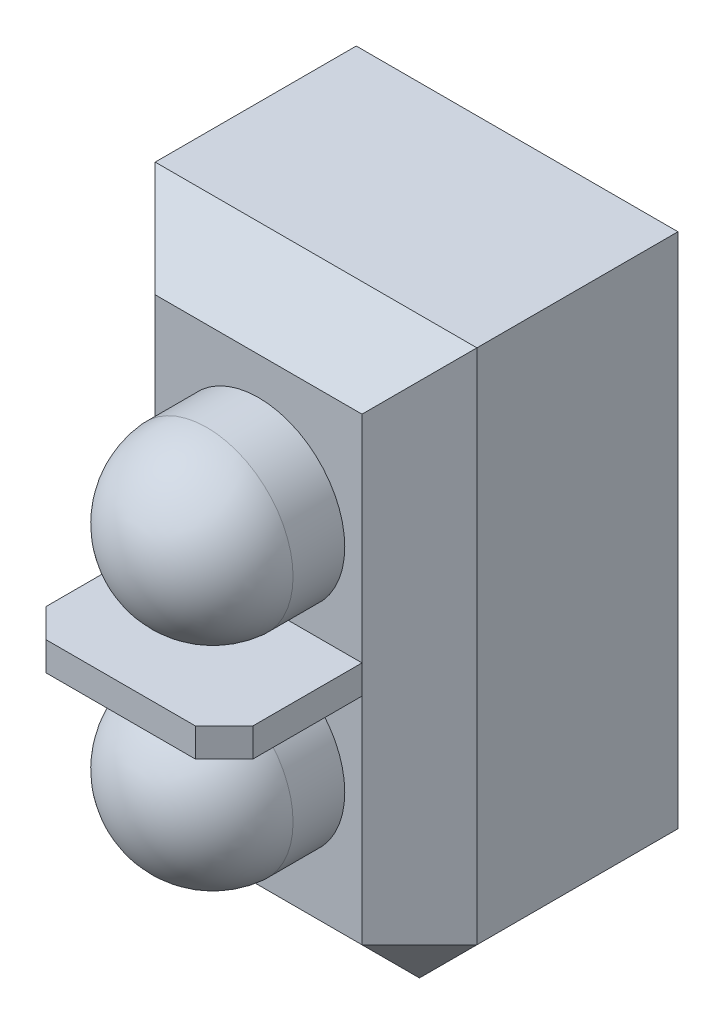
ISO-10303-21;
HEADER;
FILE_DESCRIPTION(('STEP AP214'),'2;1');
FILE_NAME('part.step','',(''),(''),'','','');
FILE_SCHEMA(('AUTOMOTIVE_DESIGN { 1 0 10303 214 1 1 1 1 }'));
ENDSEC;
DATA;
#1=APPLICATION_CONTEXT('core data for automotive mechanical design processes');
#2=APPLICATION_PROTOCOL_DEFINITION('international standard','automotive_design',2000,#1);
#3=PRODUCT_CONTEXT('',#1,'mechanical');
#4=PRODUCT('Part','Part','',(#3));
#5=PRODUCT_RELATED_PRODUCT_CATEGORY('part','',(#4));
#6=PRODUCT_DEFINITION_FORMATION('','',#4);
#7=PRODUCT_DEFINITION_CONTEXT('part definition',#1,'design');
#8=PRODUCT_DEFINITION('design','',#6,#7);
#9=PRODUCT_DEFINITION_SHAPE('','',#8);
#10=(LENGTH_UNIT() NAMED_UNIT(*) SI_UNIT(.MILLI.,.METRE.));
#11=(NAMED_UNIT(*) PLANE_ANGLE_UNIT() SI_UNIT($,.RADIAN.));
#12=(NAMED_UNIT(*) SI_UNIT($,.STERADIAN.) SOLID_ANGLE_UNIT());
#13=UNCERTAINTY_MEASURE_WITH_UNIT(LENGTH_MEASURE(1.E-05),#10,'distance_accuracy_value','');
#14=(GEOMETRIC_REPRESENTATION_CONTEXT(3) GLOBAL_UNCERTAINTY_ASSIGNED_CONTEXT((#13)) GLOBAL_UNIT_ASSIGNED_CONTEXT((#10,
#11,#12)) REPRESENTATION_CONTEXT('',''));
#15=CARTESIAN_POINT('',(0.,0.,0.));
#16=DIRECTION('',(0.,0.,1.));
#17=DIRECTION('',(1.,0.,0.));
#18=AXIS2_PLACEMENT_3D('',#15,#16,#17);
#19=CARTESIAN_POINT('',(2.8,-5.,0.));
#20=DIRECTION('',(0.,0.,1.));
#21=DIRECTION('',(1.,0.,0.));
#22=AXIS2_PLACEMENT_3D('',#19,#20,#21);
#23=PLANE('',#22);
#24=DIRECTION('',(0.,1.,0.));
#25=VECTOR('',#24,1.);
#26=CARTESIAN_POINT('',(-1.075,-1.65,0.));
#27=LINE('',#26,#25);
#28=CARTESIAN_POINT('',(-1.075,-2.05,0.));
#29=VERTEX_POINT('',#28);
#30=CARTESIAN_POINT('',(-1.075,-1.65,0.));
#31=VERTEX_POINT('',#30);
#32=EDGE_CURVE('E252',#29,#31,#27,.T.);
#33=ORIENTED_EDGE('',*,*,#32,.F.);
#34=DIRECTION('',(-1.,0.,0.));
#35=VECTOR('',#34,1.);
#36=CARTESIAN_POINT('',(-1.075,-2.05,0.));
#37=LINE('',#36,#35);
#38=CARTESIAN_POINT('',(-0.424999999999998,-2.05,0.));
#39=VERTEX_POINT('',#38);
#40=EDGE_CURVE('E265',#39,#29,#37,.T.);
#41=ORIENTED_EDGE('',*,*,#40,.F.);
#42=DIRECTION('',(0.,-1.,0.));
#43=VECTOR('',#42,1.);
#44=CARTESIAN_POINT('',(-0.424999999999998,-1.65,0.));
#45=LINE('',#44,#43);
#46=CARTESIAN_POINT('',(-0.424999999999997,-1.65,0.));
#47=VERTEX_POINT('',#46);
#48=EDGE_CURVE('E274',#47,#39,#45,.T.);
#49=ORIENTED_EDGE('',*,*,#48,.F.);
#50=DIRECTION('',(1.,0.,0.));
#51=VECTOR('',#50,1.);
#52=CARTESIAN_POINT('',(-1.075,-1.65,0.));
#53=LINE('',#52,#51);
#54=EDGE_CURVE('E255',#31,#47,#53,.T.);
#55=ORIENTED_EDGE('',*,*,#54,.F.);
#56=EDGE_LOOP('',(#33,#41,#49,#55));
#57=FACE_BOUND('',#56,.T.);
#58=DIRECTION('',(0.,1.,0.));
#59=VECTOR('',#58,1.);
#60=CARTESIAN_POINT('',(0.424999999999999,1.65,0.));
#61=LINE('',#60,#59);
#62=CARTESIAN_POINT('',(0.424999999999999,1.65,0.));
#63=VERTEX_POINT('',#62);
#64=CARTESIAN_POINT('',(0.424999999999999,2.05,0.));
#65=VERTEX_POINT('',#64);
#66=EDGE_CURVE('E323',#63,#65,#61,.T.);
#67=ORIENTED_EDGE('',*,*,#66,.F.);
#68=DIRECTION('',(-1.,0.,0.));
#69=VECTOR('',#68,1.);
#70=CARTESIAN_POINT('',(1.075,1.65,0.));
#71=LINE('',#70,#69);
#72=CARTESIAN_POINT('',(1.075,1.65,0.));
#73=VERTEX_POINT('',#72);
#74=EDGE_CURVE('E328',#73,#63,#71,.T.);
#75=ORIENTED_EDGE('',*,*,#74,.F.);
#76=DIRECTION('',(0.,-1.,0.));
#77=VECTOR('',#76,1.);
#78=CARTESIAN_POINT('',(1.075,1.65,0.));
#79=LINE('',#78,#77);
#80=CARTESIAN_POINT('',(1.075,2.05,0.));
#81=VERTEX_POINT('',#80);
#82=EDGE_CURVE('E340',#81,#73,#79,.T.);
#83=ORIENTED_EDGE('',*,*,#82,.F.);
#84=DIRECTION('',(1.,0.,0.));
#85=VECTOR('',#84,1.);
#86=CARTESIAN_POINT('',(1.075,2.05,0.));
#87=LINE('',#86,#85);
#88=EDGE_CURVE('E337',#65,#81,#87,.T.);
#89=ORIENTED_EDGE('',*,*,#88,.F.);
#90=EDGE_LOOP('',(#67,#75,#83,#89));
#91=FACE_BOUND('',#90,.T.);
#92=DIRECTION('',(0.,1.,0.));
#93=VECTOR('',#92,1.);
#94=CARTESIAN_POINT('',(2.8,5.,0.));
#95=LINE('',#94,#93);
#96=CARTESIAN_POINT('',(2.8,-3.99999999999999,0.));
#97=VERTEX_POINT('',#96);
#98=CARTESIAN_POINT('',(2.8,5.,0.));
#99=VERTEX_POINT('',#98);
#100=EDGE_CURVE('E390',#97,#99,#95,.T.);
#101=ORIENTED_EDGE('',*,*,#100,.F.);
#102=DIRECTION('',(0.707106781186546,0.707106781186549,0.));
#103=VECTOR('',#102,1.);
#104=CARTESIAN_POINT('',(2.8,-3.99999999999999,0.));
#105=LINE('',#104,#103);
#106=CARTESIAN_POINT('',(1.8,-5.,0.));
#107=VERTEX_POINT('',#106);
#108=EDGE_CURVE('E414',#97,#107,#105,.F.);
#109=ORIENTED_EDGE('',*,*,#108,.T.);
#110=DIRECTION('',(1.,0.,0.));
#111=VECTOR('',#110,1.);
#112=CARTESIAN_POINT('',(-2.8,-5.,0.));
#113=LINE('',#112,#111);
#114=CARTESIAN_POINT('',(-1.79999999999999,-5.,0.));
#115=VERTEX_POINT('',#114);
#116=EDGE_CURVE('E400',#115,#107,#113,.T.);
#117=ORIENTED_EDGE('',*,*,#116,.F.);
#118=DIRECTION('',(0.707106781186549,-0.707106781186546,0.));
#119=VECTOR('',#118,1.);
#120=CARTESIAN_POINT('',(-1.79999999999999,-5.,0.));
#121=LINE('',#120,#119);
#122=CARTESIAN_POINT('',(-2.8,-4.,0.));
#123=VERTEX_POINT('',#122);
#124=EDGE_CURVE('E412',#115,#123,#121,.F.);
#125=ORIENTED_EDGE('',*,*,#124,.T.);
#126=DIRECTION('',(0.,-1.,0.));
#127=VECTOR('',#126,1.);
#128=CARTESIAN_POINT('',(-2.8,5.,0.));
#129=LINE('',#128,#127);
#130=CARTESIAN_POINT('',(-2.8,5.,0.));
#131=VERTEX_POINT('',#130);
#132=EDGE_CURVE('E397',#131,#123,#129,.T.);
#133=ORIENTED_EDGE('',*,*,#132,.F.);
#134=DIRECTION('',(-1.,0.,0.));
#135=VECTOR('',#134,1.);
#136=CARTESIAN_POINT('',(-2.8,5.,0.));
#137=LINE('',#136,#135);
#138=EDGE_CURVE('E393',#99,#131,#137,.T.);
#139=ORIENTED_EDGE('',*,*,#138,.F.);
#140=EDGE_LOOP('',(#101,#109,#117,#125,#133,#139));
#141=FACE_BOUND('',#140,.T.);
#142=DIRECTION('',(-1.,0.,0.));
#143=VECTOR('',#142,1.);
#144=CARTESIAN_POINT('',(-1.075,1.65,0.));
#145=LINE('',#144,#143);
#146=CARTESIAN_POINT('',(-0.424999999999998,1.65,0.));
#147=VERTEX_POINT('',#146);
#148=CARTESIAN_POINT('',(-1.075,1.65,0.));
#149=VERTEX_POINT('',#148);
#150=EDGE_CURVE('E290',#147,#149,#145,.T.);
#151=ORIENTED_EDGE('',*,*,#150,.F.);
#152=DIRECTION('',(0.,-1.,0.));
#153=VECTOR('',#152,1.);
#154=CARTESIAN_POINT('',(-0.424999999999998,1.65,0.));
#155=LINE('',#154,#153);
#156=CARTESIAN_POINT('',(-0.424999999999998,2.05,0.));
#157=VERTEX_POINT('',#156);
#158=EDGE_CURVE('E295',#157,#147,#155,.T.);
#159=ORIENTED_EDGE('',*,*,#158,.F.);
#160=DIRECTION('',(1.,0.,0.));
#161=VECTOR('',#160,1.);
#162=CARTESIAN_POINT('',(-1.075,2.05,0.));
#163=LINE('',#162,#161);
#164=CARTESIAN_POINT('',(-1.075,2.05,0.));
#165=VERTEX_POINT('',#164);
#166=EDGE_CURVE('E307',#165,#157,#163,.T.);
#167=ORIENTED_EDGE('',*,*,#166,.F.);
#168=DIRECTION('',(0.,1.,0.));
#169=VECTOR('',#168,1.);
#170=CARTESIAN_POINT('',(-1.075,1.65,0.));
#171=LINE('',#170,#169);
#172=EDGE_CURVE('E304',#149,#165,#171,.T.);
#173=ORIENTED_EDGE('',*,*,#172,.F.);
#174=EDGE_LOOP('',(#151,#159,#167,#173));
#175=FACE_BOUND('',#174,.T.);
#176=DIRECTION('',(1.,0.,0.));
#177=VECTOR('',#176,1.);
#178=CARTESIAN_POINT('',(1.075,-1.65,0.));
#179=LINE('',#178,#177);
#180=CARTESIAN_POINT('',(0.424999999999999,-1.65,0.));
#181=VERTEX_POINT('',#180);
#182=CARTESIAN_POINT('',(1.075,-1.65,0.));
#183=VERTEX_POINT('',#182);
#184=EDGE_CURVE('E251',#181,#183,#179,.T.);
#185=ORIENTED_EDGE('',*,*,#184,.F.);
#186=DIRECTION('',(0.,1.,0.));
#187=VECTOR('',#186,1.);
#188=CARTESIAN_POINT('',(0.424999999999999,-1.65,0.));
#189=LINE('',#188,#187);
#190=CARTESIAN_POINT('',(0.424999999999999,-2.05,0.));
#191=VERTEX_POINT('',#190);
#192=EDGE_CURVE('E248',#191,#181,#189,.T.);
#193=ORIENTED_EDGE('',*,*,#192,.F.);
#194=DIRECTION('',(-1.,0.,0.));
#195=VECTOR('',#194,1.);
#196=CARTESIAN_POINT('',(1.075,-2.05,0.));
#197=LINE('',#196,#195);
#198=CARTESIAN_POINT('',(1.075,-2.05,0.));
#199=VERTEX_POINT('',#198);
#200=EDGE_CURVE('E55',#199,#191,#197,.T.);
#201=ORIENTED_EDGE('',*,*,#200,.F.);
#202=DIRECTION('',(0.,-1.,0.));
#203=VECTOR('',#202,1.);
#204=CARTESIAN_POINT('',(1.075,-1.65,0.));
#205=LINE('',#204,#203);
#206=EDGE_CURVE('E50',#183,#199,#205,.T.);
#207=ORIENTED_EDGE('',*,*,#206,.F.);
#208=EDGE_LOOP('',(#185,#193,#201,#207));
#209=FACE_BOUND('',#208,.T.);
#210=ADVANCED_FACE('F35',(#57,#91,#141,#175,#209),#23,.F.);
#211=CARTESIAN_POINT('',(2.8,-5.,4.5));
#212=DIRECTION('',(0.,0.,1.));
#213=DIRECTION('',(1.,0.,0.));
#214=AXIS2_PLACEMENT_3D('',#211,#212,#213);
#215=PLANE('',#214);
#216=CARTESIAN_POINT('',(0.,1.85,4.5));
#217=DIRECTION('',(0.,0.,1.));
#218=DIRECTION('',(1.,0.,0.));
#219=AXIS2_PLACEMENT_3D('',#216,#217,#218);
#220=CIRCLE('',#219,1.5);
#221=CARTESIAN_POINT('',(1.5,1.85,4.5));
#222=VERTEX_POINT('',#221);
#223=EDGE_CURVE('E386',#222,#222,#220,.T.);
#224=ORIENTED_EDGE('',*,*,#223,.F.);
#225=EDGE_LOOP('',(#224));
#226=FACE_BOUND('',#225,.T.);
#227=DIRECTION('',(0.,-1.,0.));
#228=VECTOR('',#227,1.);
#229=CARTESIAN_POINT('',(-1.79999999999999,-5.,4.5));
#230=LINE('',#229,#228);
#231=CARTESIAN_POINT('',(-1.8,4.,4.5));
#232=VERTEX_POINT('',#231);
#233=CARTESIAN_POINT('',(-1.8,0.25,4.5));
#234=VERTEX_POINT('',#233);
#235=EDGE_CURVE('E427',#232,#234,#230,.T.);
#236=ORIENTED_EDGE('',*,*,#235,.T.);
#237=DIRECTION('',(-1.,0.,0.));
#238=VECTOR('',#237,1.);
#239=CARTESIAN_POINT('',(-1.8,0.25,4.5));
#240=LINE('',#239,#238);
#241=CARTESIAN_POINT('',(1.8,0.25,4.5));
#242=VERTEX_POINT('',#241);
#243=EDGE_CURVE('E367',#242,#234,#240,.T.);
#244=ORIENTED_EDGE('',*,*,#243,.F.);
#245=DIRECTION('',(0.,1.,0.));
#246=VECTOR('',#245,1.);
#247=CARTESIAN_POINT('',(1.8,5.,4.5));
#248=LINE('',#247,#246);
#249=CARTESIAN_POINT('',(1.8,4.,4.5));
#250=VERTEX_POINT('',#249);
#251=EDGE_CURVE('E434',#242,#250,#248,.T.);
#252=ORIENTED_EDGE('',*,*,#251,.T.);
#253=DIRECTION('',(-1.,0.,0.));
#254=VECTOR('',#253,1.);
#255=CARTESIAN_POINT('',(-2.8,4.,4.5));
#256=LINE('',#255,#254);
#257=EDGE_CURVE('E430',#250,#232,#256,.T.);
#258=ORIENTED_EDGE('',*,*,#257,.T.);
#259=EDGE_LOOP('',(#236,#244,#252,#258));
#260=FACE_BOUND('',#259,.T.);
#261=ADVANCED_FACE('F508',(#226,#260),#215,.T.);
#262=CARTESIAN_POINT('',(0.,-1.85,4.5));
#263=DIRECTION('',(0.,0.,1.));
#264=DIRECTION('',(1.,0.,0.));
#265=AXIS2_PLACEMENT_3D('',#262,#263,#264);
#266=CIRCLE('',#265,1.5);
#267=CARTESIAN_POINT('',(1.5,-1.85,4.5));
#268=VERTEX_POINT('',#267);
#269=EDGE_CURVE('E382',#268,#268,#266,.T.);
#270=ORIENTED_EDGE('',*,*,#269,.F.);
#271=EDGE_LOOP('',(#270));
#272=FACE_BOUND('',#271,.T.);
#273=CARTESIAN_POINT('',(1.8,-3.99999999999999,4.5));
#274=VERTEX_POINT('',#273);
#275=CARTESIAN_POINT('',(1.8,-0.25,4.5));
#276=VERTEX_POINT('',#275);
#277=EDGE_CURVE('E435',#274,#276,#248,.T.);
#278=ORIENTED_EDGE('',*,*,#277,.T.);
#279=DIRECTION('',(1.,0.,0.));
#280=VECTOR('',#279,1.);
#281=CARTESIAN_POINT('',(-1.8,-0.25,4.5));
#282=LINE('',#281,#280);
#283=CARTESIAN_POINT('',(-1.8,-0.25,4.5));
#284=VERTEX_POINT('',#283);
#285=EDGE_CURVE('E361',#284,#276,#282,.T.);
#286=ORIENTED_EDGE('',*,*,#285,.F.);
#287=CARTESIAN_POINT('',(-1.79999999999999,-3.99999999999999,4.5));
#288=VERTEX_POINT('',#287);
#289=EDGE_CURVE('E426',#284,#288,#230,.T.);
#290=ORIENTED_EDGE('',*,*,#289,.T.);
#291=DIRECTION('',(1.,0.,0.));
#292=VECTOR('',#291,1.);
#293=CARTESIAN_POINT('',(2.8,-3.99999999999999,4.5));
#294=LINE('',#293,#292);
#295=EDGE_CURVE('E432',#288,#274,#294,.T.);
#296=ORIENTED_EDGE('',*,*,#295,.T.);
#297=EDGE_LOOP('',(#278,#286,#290,#296));
#298=FACE_BOUND('',#297,.T.);
#299=ADVANCED_FACE('F542',(#272,#298),#215,.T.);
#300=CARTESIAN_POINT('',(2.8,5.,4.5));
#301=DIRECTION('',(-1.,0.,0.));
#302=DIRECTION('',(0.,0.,1.));
#303=AXIS2_PLACEMENT_3D('',#300,#301,#302);
#304=PLANE('',#303);
#305=DIRECTION('',(0.,-1.,0.));
#306=VECTOR('',#305,1.);
#307=CARTESIAN_POINT('',(2.8,-5.,3.5));
#308=LINE('',#307,#306);
#309=CARTESIAN_POINT('',(2.8,5.,3.5));
#310=VERTEX_POINT('',#309);
#311=CARTESIAN_POINT('',(2.8,-3.99999999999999,3.5));
#312=VERTEX_POINT('',#311);
#313=EDGE_CURVE('E407',#310,#312,#308,.T.);
#314=ORIENTED_EDGE('',*,*,#313,.T.);
#315=DIRECTION('',(0.,0.,-1.));
#316=VECTOR('',#315,1.);
#317=CARTESIAN_POINT('',(2.8,-3.99999999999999,4.5));
#318=LINE('',#317,#316);
#319=EDGE_CURVE('E409',#312,#97,#318,.T.);
#320=ORIENTED_EDGE('',*,*,#319,.T.);
#321=ORIENTED_EDGE('',*,*,#100,.T.);
#322=DIRECTION('',(0.,0.,-1.));
#323=VECTOR('',#322,1.);
#324=CARTESIAN_POINT('',(2.8,5.,4.5));
#325=LINE('',#324,#323);
#326=EDGE_CURVE('E405',#310,#99,#325,.T.);
#327=ORIENTED_EDGE('',*,*,#326,.F.);
#328=EDGE_LOOP('',(#314,#320,#321,#327));
#329=FACE_BOUND('',#328,.T.);
#330=ADVANCED_FACE('F552',(#329),#304,.F.);
#331=CARTESIAN_POINT('',(-2.8,5.,4.5));
#332=DIRECTION('',(0.,-1.,0.));
#333=DIRECTION('',(0.,0.,-1.));
#334=AXIS2_PLACEMENT_3D('',#331,#332,#333);
#335=PLANE('',#334);
#336=DIRECTION('',(0.,0.,-1.));
#337=VECTOR('',#336,1.);
#338=CARTESIAN_POINT('',(-2.8,5.,4.5));
#339=LINE('',#338,#337);
#340=CARTESIAN_POINT('',(-2.8,5.,3.5));
#341=VERTEX_POINT('',#340);
#342=EDGE_CURVE('E403',#341,#131,#339,.T.);
#343=ORIENTED_EDGE('',*,*,#342,.F.);
#344=DIRECTION('',(1.,0.,0.));
#345=VECTOR('',#344,1.);
#346=CARTESIAN_POINT('',(2.8,5.,3.5));
#347=LINE('',#346,#345);
#348=EDGE_CURVE('E438',#341,#310,#347,.T.);
#349=ORIENTED_EDGE('',*,*,#348,.T.);
#350=ORIENTED_EDGE('',*,*,#326,.T.);
#351=ORIENTED_EDGE('',*,*,#138,.T.);
#352=EDGE_LOOP('',(#343,#349,#350,#351));
#353=FACE_BOUND('',#352,.T.);
#354=ADVANCED_FACE('F560',(#353),#335,.F.);
#355=CARTESIAN_POINT('',(-2.8,5.,4.5));
#356=DIRECTION('',(1.,0.,0.));
#357=DIRECTION('',(0.,1.,0.));
#358=AXIS2_PLACEMENT_3D('',#355,#356,#357);
#359=PLANE('',#358);
#360=ORIENTED_EDGE('',*,*,#132,.T.);
#361=DIRECTION('',(0.,0.,1.));
#362=VECTOR('',#361,1.);
#363=CARTESIAN_POINT('',(-2.8,-4.,4.5));
#364=LINE('',#363,#362);
#365=CARTESIAN_POINT('',(-2.8,-4.,3.5));
#366=VERTEX_POINT('',#365);
#367=EDGE_CURVE('E424',#123,#366,#364,.T.);
#368=ORIENTED_EDGE('',*,*,#367,.T.);
#369=DIRECTION('',(0.,1.,0.));
#370=VECTOR('',#369,1.);
#371=CARTESIAN_POINT('',(-2.8,5.,3.5));
#372=LINE('',#371,#370);
#373=EDGE_CURVE('E422',#366,#341,#372,.T.);
#374=ORIENTED_EDGE('',*,*,#373,.T.);
#375=ORIENTED_EDGE('',*,*,#342,.T.);
#376=EDGE_LOOP('',(#360,#368,#374,#375));
#377=FACE_BOUND('',#376,.T.);
#378=ADVANCED_FACE('F561',(#377),#359,.F.);
#379=CARTESIAN_POINT('',(-2.8,-5.,4.5));
#380=DIRECTION('',(0.,1.,0.));
#381=DIRECTION('',(0.,0.,1.));
#382=AXIS2_PLACEMENT_3D('',#379,#380,#381);
#383=PLANE('',#382);
#384=ORIENTED_EDGE('',*,*,#116,.T.);
#385=DIRECTION('',(0.,0.,1.));
#386=VECTOR('',#385,1.);
#387=CARTESIAN_POINT('',(1.8,-5.,4.5));
#388=LINE('',#387,#386);
#389=CARTESIAN_POINT('',(1.8,-5.,3.5));
#390=VERTEX_POINT('',#389);
#391=EDGE_CURVE('E420',#107,#390,#388,.T.);
#392=ORIENTED_EDGE('',*,*,#391,.T.);
#393=DIRECTION('',(-1.,0.,0.));
#394=VECTOR('',#393,1.);
#395=CARTESIAN_POINT('',(-2.8,-5.,3.5));
#396=LINE('',#395,#394);
#397=CARTESIAN_POINT('',(-1.79999999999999,-5.,3.5));
#398=VERTEX_POINT('',#397);
#399=EDGE_CURVE('E416',#390,#398,#396,.T.);
#400=ORIENTED_EDGE('',*,*,#399,.T.);
#401=DIRECTION('',(0.,0.,-1.));
#402=VECTOR('',#401,1.);
#403=CARTESIAN_POINT('',(-1.79999999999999,-5.,4.5));
#404=LINE('',#403,#402);
#405=EDGE_CURVE('E418',#398,#115,#404,.T.);
#406=ORIENTED_EDGE('',*,*,#405,.T.);
#407=EDGE_LOOP('',(#384,#392,#400,#406));
#408=FACE_BOUND('',#407,.T.);
#409=ADVANCED_FACE('F563',(#408),#383,.F.);
#410=CARTESIAN_POINT('',(-1.79999999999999,-5.,4.5));
#411=DIRECTION('',(0.707106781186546,0.707106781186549,0.));
#412=DIRECTION('',(-0.707106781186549,0.707106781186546,0.));
#413=AXIS2_PLACEMENT_3D('',#410,#411,#412);
#414=PLANE('',#413);
#415=ORIENTED_EDGE('',*,*,#124,.F.);
#416=ORIENTED_EDGE('',*,*,#405,.F.);
#417=DIRECTION('',(-0.707106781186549,0.707106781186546,0.));
#418=VECTOR('',#417,1.);
#419=CARTESIAN_POINT('',(-2.8,-4.,3.5));
#420=LINE('',#419,#418);
#421=EDGE_CURVE('E394',#366,#398,#420,.F.);
#422=ORIENTED_EDGE('',*,*,#421,.F.);
#423=ORIENTED_EDGE('',*,*,#367,.F.);
#424=EDGE_LOOP('',(#415,#416,#422,#423));
#425=FACE_BOUND('',#424,.T.);
#426=ADVANCED_FACE('F533',(#425),#414,.F.);
#427=CARTESIAN_POINT('',(-1.79999999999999,-5.,4.5));
#428=DIRECTION('',(-0.707106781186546,0.,0.707106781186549));
#429=DIRECTION('',(0.707106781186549,0.,0.707106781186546));
#430=AXIS2_PLACEMENT_3D('',#427,#428,#429);
#431=PLANE('',#430);
#432=DIRECTION('',(-0.577350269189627,0.577350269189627,-0.577350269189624));
#433=VECTOR('',#432,1.);
#434=CARTESIAN_POINT('',(1.20000000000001,0.999999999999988,7.49999999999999));
#435=LINE('',#434,#433);
#436=EDGE_CURVE('E456',#341,#232,#435,.F.);
#437=ORIENTED_EDGE('',*,*,#436,.F.);
#438=ORIENTED_EDGE('',*,*,#373,.F.);
#439=DIRECTION('',(-0.707106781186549,0.,-0.707106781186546));
#440=VECTOR('',#439,1.);
#441=CARTESIAN_POINT('',(-2.8,-4.,3.5));
#442=LINE('',#441,#440);
#443=EDGE_CURVE('E459',#288,#366,#442,.T.);
#444=ORIENTED_EDGE('',*,*,#443,.F.);
#445=ORIENTED_EDGE('',*,*,#289,.F.);
#446=DIRECTION('',(0.,-1.,0.));
#447=VECTOR('',#446,1.);
#448=CARTESIAN_POINT('',(-1.8,-0.25,4.5));
#449=LINE('',#448,#447);
#450=EDGE_CURVE('E370',#234,#284,#449,.T.);
#451=ORIENTED_EDGE('',*,*,#450,.F.);
#452=ORIENTED_EDGE('',*,*,#235,.F.);
#453=EDGE_LOOP('',(#437,#438,#444,#445,#451,#452));
#454=FACE_BOUND('',#453,.T.);
#455=ADVANCED_FACE('F504',(#454),#431,.T.);
#456=CARTESIAN_POINT('',(-2.8,-4.,3.5));
#457=DIRECTION('',(-0.577350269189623,-0.577350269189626,0.577350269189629));
#458=DIRECTION('',(0.,-0.707106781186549,-0.707106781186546));
#459=AXIS2_PLACEMENT_3D('',#456,#457,#458);
#460=PLANE('',#459);
#461=ORIENTED_EDGE('',*,*,#443,.T.);
#462=ORIENTED_EDGE('',*,*,#421,.T.);
#463=DIRECTION('',(0.,0.707106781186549,0.707106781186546));
#464=VECTOR('',#463,1.);
#465=CARTESIAN_POINT('',(-1.79999999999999,-4.5,4.));
#466=LINE('',#465,#464);
#467=EDGE_CURVE('E453',#288,#398,#466,.F.);
#468=ORIENTED_EDGE('',*,*,#467,.F.);
#469=EDGE_LOOP('',(#461,#462,#468));
#470=FACE_BOUND('',#469,.T.);
#471=ADVANCED_FACE('F535',(#470),#460,.T.);
#472=CARTESIAN_POINT('',(2.8,4.,4.5));
#473=DIRECTION('',(0.,0.707106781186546,0.707106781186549));
#474=DIRECTION('',(0.,-0.707106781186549,0.707106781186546));
#475=AXIS2_PLACEMENT_3D('',#472,#473,#474);
#476=PLANE('',#475);
#477=ORIENTED_EDGE('',*,*,#436,.T.);
#478=ORIENTED_EDGE('',*,*,#257,.F.);
#479=DIRECTION('',(0.577350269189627,0.577350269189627,-0.577350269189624));
#480=VECTOR('',#479,1.);
#481=CARTESIAN_POINT('',(2.13333333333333,4.33333333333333,4.16666666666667));
#482=LINE('',#481,#480);
#483=EDGE_CURVE('E450',#310,#250,#482,.F.);
#484=ORIENTED_EDGE('',*,*,#483,.F.);
#485=ORIENTED_EDGE('',*,*,#348,.F.);
#486=EDGE_LOOP('',(#477,#478,#484,#485));
#487=FACE_BOUND('',#486,.T.);
#488=ADVANCED_FACE('F523',(#487),#476,.T.);
#489=CARTESIAN_POINT('',(2.8,-3.99999999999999,4.5));
#490=DIRECTION('',(0.,-0.707106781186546,0.707106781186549));
#491=DIRECTION('',(0.,-0.707106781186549,-0.707106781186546));
#492=AXIS2_PLACEMENT_3D('',#489,#490,#491);
#493=PLANE('',#492);
#494=ORIENTED_EDGE('',*,*,#467,.T.);
#495=ORIENTED_EDGE('',*,*,#399,.F.);
#496=DIRECTION('',(0.,-0.707106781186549,-0.707106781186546));
#497=VECTOR('',#496,1.);
#498=CARTESIAN_POINT('',(1.8,-5.,3.5));
#499=LINE('',#498,#497);
#500=EDGE_CURVE('E447',#274,#390,#499,.T.);
#501=ORIENTED_EDGE('',*,*,#500,.F.);
#502=ORIENTED_EDGE('',*,*,#295,.F.);
#503=EDGE_LOOP('',(#494,#495,#501,#502));
#504=FACE_BOUND('',#503,.T.);
#505=ADVANCED_FACE('F540',(#504),#493,.T.);
#506=CARTESIAN_POINT('',(1.8,-5.,4.5));
#507=DIRECTION('',(0.707106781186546,0.,0.707106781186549));
#508=DIRECTION('',(0.707106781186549,0.,-0.707106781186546));
#509=AXIS2_PLACEMENT_3D('',#506,#507,#508);
#510=PLANE('',#509);
#511=ORIENTED_EDGE('',*,*,#483,.T.);
#512=ORIENTED_EDGE('',*,*,#251,.F.);
#513=DIRECTION('',(0.,1.,0.));
#514=VECTOR('',#513,1.);
#515=CARTESIAN_POINT('',(1.8,-0.25,4.5));
#516=LINE('',#515,#514);
#517=EDGE_CURVE('E356',#276,#242,#516,.T.);
#518=ORIENTED_EDGE('',*,*,#517,.F.);
#519=ORIENTED_EDGE('',*,*,#277,.F.);
#520=DIRECTION('',(-0.707106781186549,0.,0.707106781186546));
#521=VECTOR('',#520,1.);
#522=CARTESIAN_POINT('',(2.3,-3.99999999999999,4.));
#523=LINE('',#522,#521);
#524=EDGE_CURVE('E444',#312,#274,#523,.T.);
#525=ORIENTED_EDGE('',*,*,#524,.F.);
#526=ORIENTED_EDGE('',*,*,#313,.F.);
#527=EDGE_LOOP('',(#511,#512,#518,#519,#525,#526));
#528=FACE_BOUND('',#527,.T.);
#529=ADVANCED_FACE('F516',(#528),#510,.T.);
#530=CARTESIAN_POINT('',(1.8,-5.,3.5));
#531=DIRECTION('',(0.577350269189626,-0.577350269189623,0.577350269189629));
#532=DIRECTION('',(0.707106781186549,0.,-0.707106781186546));
#533=AXIS2_PLACEMENT_3D('',#530,#531,#532);
#534=PLANE('',#533);
#535=ORIENTED_EDGE('',*,*,#524,.T.);
#536=ORIENTED_EDGE('',*,*,#500,.T.);
#537=DIRECTION('',(-0.707106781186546,-0.707106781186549,0.));
#538=VECTOR('',#537,1.);
#539=CARTESIAN_POINT('',(1.8,-5.,3.5));
#540=LINE('',#539,#538);
#541=EDGE_CURVE('E441',#312,#390,#540,.T.);
#542=ORIENTED_EDGE('',*,*,#541,.F.);
#543=EDGE_LOOP('',(#535,#536,#542));
#544=FACE_BOUND('',#543,.T.);
#545=ADVANCED_FACE('F546',(#544),#534,.T.);
#546=CARTESIAN_POINT('',(2.8,-3.99999999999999,4.5));
#547=DIRECTION('',(-0.707106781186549,0.707106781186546,0.));
#548=DIRECTION('',(-0.707106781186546,-0.707106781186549,0.));
#549=AXIS2_PLACEMENT_3D('',#546,#547,#548);
#550=PLANE('',#549);
#551=ORIENTED_EDGE('',*,*,#541,.T.);
#552=ORIENTED_EDGE('',*,*,#391,.F.);
#553=ORIENTED_EDGE('',*,*,#108,.F.);
#554=ORIENTED_EDGE('',*,*,#319,.F.);
#555=EDGE_LOOP('',(#551,#552,#553,#554));
#556=FACE_BOUND('',#555,.T.);
#557=ADVANCED_FACE('F549',(#556),#550,.F.);
#558=CARTESIAN_POINT('',(0.,1.85,5.4));
#559=DIRECTION('',(0.,0.,-1.));
#560=DIRECTION('',(-1.,0.,0.));
#561=AXIS2_PLACEMENT_3D('',#558,#559,#560);
#562=CYLINDRICAL_SURFACE('',#561,1.5);
#563=CARTESIAN_POINT('',(0.,1.85,5.4));
#564=DIRECTION('',(0.,0.,1.));
#565=DIRECTION('',(1.,0.,0.));
#566=AXIS2_PLACEMENT_3D('',#563,#564,#565);
#567=CIRCLE('',#566,1.5);
#568=CARTESIAN_POINT('',(1.5,1.85,5.4));
#569=VERTEX_POINT('',#568);
#570=EDGE_CURVE('E389',#569,#569,#567,.T.);
#571=ORIENTED_EDGE('',*,*,#570,.F.);
#572=EDGE_LOOP('',(#571));
#573=FACE_BOUND('',#572,.T.);
#574=ORIENTED_EDGE('',*,*,#223,.T.);
#575=EDGE_LOOP('',(#574));
#576=FACE_BOUND('',#575,.T.);
#577=ADVANCED_FACE('F583',(#573,#576),#562,.T.);
#578=CARTESIAN_POINT('',(0.,1.85,5.29642857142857));
#579=DIRECTION('',(0.,0.,1.));
#580=DIRECTION('',(1.,0.,0.));
#581=AXIS2_PLACEMENT_3D('',#578,#579,#580);
#582=SPHERICAL_SURFACE('',#581,1.50357142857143);
#583=ORIENTED_EDGE('',*,*,#570,.T.);
#584=EDGE_LOOP('',(#583));
#585=FACE_BOUND('',#584,.T.);
#586=ADVANCED_FACE('F586',(#585),#582,.T.);
#587=CARTESIAN_POINT('',(0.,-1.85,5.4));
#588=DIRECTION('',(0.,0.,-1.));
#589=DIRECTION('',(-1.,0.,0.));
#590=AXIS2_PLACEMENT_3D('',#587,#588,#589);
#591=CYLINDRICAL_SURFACE('',#590,1.5);
#592=CARTESIAN_POINT('',(0.,-1.85,5.4));
#593=DIRECTION('',(0.,0.,1.));
#594=DIRECTION('',(1.,0.,0.));
#595=AXIS2_PLACEMENT_3D('',#592,#593,#594);
#596=CIRCLE('',#595,1.5);
#597=CARTESIAN_POINT('',(1.5,-1.85,5.4));
#598=VERTEX_POINT('',#597);
#599=EDGE_CURVE('E385',#598,#598,#596,.T.);
#600=ORIENTED_EDGE('',*,*,#599,.F.);
#601=EDGE_LOOP('',(#600));
#602=FACE_BOUND('',#601,.T.);
#603=ORIENTED_EDGE('',*,*,#269,.T.);
#604=EDGE_LOOP('',(#603));
#605=FACE_BOUND('',#604,.T.);
#606=ADVANCED_FACE('F588',(#602,#605),#591,.T.);
#607=CARTESIAN_POINT('',(0.,-1.85,5.29642857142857));
#608=DIRECTION('',(0.,0.,1.));
#609=DIRECTION('',(1.,0.,0.));
#610=AXIS2_PLACEMENT_3D('',#607,#608,#609);
#611=SPHERICAL_SURFACE('',#610,1.50357142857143);
#612=ORIENTED_EDGE('',*,*,#599,.T.);
#613=EDGE_LOOP('',(#612));
#614=FACE_BOUND('',#613,.T.);
#615=ADVANCED_FACE('F591',(#614),#611,.T.);
#616=CARTESIAN_POINT('',(1.8,-0.25,6.9));
#617=DIRECTION('',(-1.,0.,0.));
#618=DIRECTION('',(0.,0.,1.));
#619=AXIS2_PLACEMENT_3D('',#616,#617,#618);
#620=PLANE('',#619);
#621=DIRECTION('',(0.,0.,-1.));
#622=VECTOR('',#621,1.);
#623=CARTESIAN_POINT('',(1.8,0.25,6.9));
#624=LINE('',#623,#622);
#625=CARTESIAN_POINT('',(1.8,0.25,6.4));
#626=VERTEX_POINT('',#625);
#627=EDGE_CURVE('E380',#626,#242,#624,.T.);
#628=ORIENTED_EDGE('',*,*,#627,.F.);
#629=DIRECTION('',(0.,-1.,0.));
#630=VECTOR('',#629,1.);
#631=CARTESIAN_POINT('',(1.8,-0.25,6.4));
#632=LINE('',#631,#630);
#633=CARTESIAN_POINT('',(1.8,-0.25,6.4));
#634=VERTEX_POINT('',#633);
#635=EDGE_CURVE('E11',#626,#634,#632,.T.);
#636=ORIENTED_EDGE('',*,*,#635,.T.);
#637=DIRECTION('',(0.,0.,-1.));
#638=VECTOR('',#637,1.);
#639=CARTESIAN_POINT('',(1.8,-0.25,6.9));
#640=LINE('',#639,#638);
#641=EDGE_CURVE('E364',#634,#276,#640,.T.);
#642=ORIENTED_EDGE('',*,*,#641,.T.);
#643=ORIENTED_EDGE('',*,*,#517,.T.);
#644=EDGE_LOOP('',(#628,#636,#642,#643));
#645=FACE_BOUND('',#644,.T.);
#646=ADVANCED_FACE('F593',(#645),#620,.F.);
#647=CARTESIAN_POINT('',(-1.8,0.25,6.9));
#648=DIRECTION('',(0.,-1.,0.));
#649=DIRECTION('',(0.,0.,-1.));
#650=AXIS2_PLACEMENT_3D('',#647,#648,#649);
#651=PLANE('',#650);
#652=DIRECTION('',(0.,0.,-1.));
#653=VECTOR('',#652,1.);
#654=CARTESIAN_POINT('',(-1.8,0.25,6.9));
#655=LINE('',#654,#653);
#656=CARTESIAN_POINT('',(-1.8,0.25,6.4));
#657=VERTEX_POINT('',#656);
#658=EDGE_CURVE('E378',#657,#234,#655,.T.);
#659=ORIENTED_EDGE('',*,*,#658,.F.);
#660=DIRECTION('',(-0.707106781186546,0.,-0.707106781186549));
#661=VECTOR('',#660,1.);
#662=CARTESIAN_POINT('',(-1.3,0.25,6.9));
#663=LINE('',#662,#661);
#664=CARTESIAN_POINT('',(-1.3,0.25,6.9));
#665=VERTEX_POINT('',#664);
#666=EDGE_CURVE('E43',#657,#665,#663,.F.);
#667=ORIENTED_EDGE('',*,*,#666,.T.);
#668=DIRECTION('',(-1.,0.,0.));
#669=VECTOR('',#668,1.);
#670=CARTESIAN_POINT('',(-1.8,0.25,6.9));
#671=LINE('',#670,#669);
#672=CARTESIAN_POINT('',(1.29999999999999,0.25,6.9));
#673=VERTEX_POINT('',#672);
#674=EDGE_CURVE('E357',#673,#665,#671,.T.);
#675=ORIENTED_EDGE('',*,*,#674,.F.);
#676=DIRECTION('',(-0.707106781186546,0.,0.707106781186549));
#677=VECTOR('',#676,1.);
#678=CARTESIAN_POINT('',(1.29999999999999,0.25,6.9));
#679=LINE('',#678,#677);
#680=EDGE_CURVE('E479',#673,#626,#679,.F.);
#681=ORIENTED_EDGE('',*,*,#680,.T.);
#682=ORIENTED_EDGE('',*,*,#627,.T.);
#683=ORIENTED_EDGE('',*,*,#243,.T.);
#684=EDGE_LOOP('',(#659,#667,#675,#681,#682,#683));
#685=FACE_BOUND('',#684,.T.);
#686=ADVANCED_FACE('F484',(#685),#651,.F.);
#687=CARTESIAN_POINT('',(-1.8,-0.25,6.9));
#688=DIRECTION('',(1.,0.,0.));
#689=DIRECTION('',(0.,0.,-1.));
#690=AXIS2_PLACEMENT_3D('',#687,#688,#689);
#691=PLANE('',#690);
#692=DIRECTION('',(0.,0.,-1.));
#693=VECTOR('',#692,1.);
#694=CARTESIAN_POINT('',(-1.8,-0.25,6.9));
#695=LINE('',#694,#693);
#696=CARTESIAN_POINT('',(-1.8,-0.25,6.4));
#697=VERTEX_POINT('',#696);
#698=EDGE_CURVE('E376',#697,#284,#695,.T.);
#699=ORIENTED_EDGE('',*,*,#698,.F.);
#700=DIRECTION('',(0.,1.,0.));
#701=VECTOR('',#700,1.);
#702=CARTESIAN_POINT('',(-1.8,-0.25,6.4));
#703=LINE('',#702,#701);
#704=EDGE_CURVE('E477',#697,#657,#703,.T.);
#705=ORIENTED_EDGE('',*,*,#704,.T.);
#706=ORIENTED_EDGE('',*,*,#658,.T.);
#707=ORIENTED_EDGE('',*,*,#450,.T.);
#708=EDGE_LOOP('',(#699,#705,#706,#707));
#709=FACE_BOUND('',#708,.T.);
#710=ADVANCED_FACE('F498',(#709),#691,.F.);
#711=CARTESIAN_POINT('',(-1.8,-0.25,6.9));
#712=DIRECTION('',(0.,1.,0.));
#713=DIRECTION('',(0.,0.,1.));
#714=AXIS2_PLACEMENT_3D('',#711,#712,#713);
#715=PLANE('',#714);
#716=DIRECTION('',(1.,0.,0.));
#717=VECTOR('',#716,1.);
#718=CARTESIAN_POINT('',(-1.8,-0.25,6.9));
#719=LINE('',#718,#717);
#720=CARTESIAN_POINT('',(-1.3,-0.25,6.9));
#721=VERTEX_POINT('',#720);
#722=CARTESIAN_POINT('',(1.29999999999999,-0.25,6.9));
#723=VERTEX_POINT('',#722);
#724=EDGE_CURVE('E360',#721,#723,#719,.T.);
#725=ORIENTED_EDGE('',*,*,#724,.F.);
#726=DIRECTION('',(0.707106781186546,0.,0.707106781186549));
#727=VECTOR('',#726,1.);
#728=CARTESIAN_POINT('',(-1.3,-0.25,6.9));
#729=LINE('',#728,#727);
#730=EDGE_CURVE('E475',#721,#697,#729,.F.);
#731=ORIENTED_EDGE('',*,*,#730,.T.);
#732=ORIENTED_EDGE('',*,*,#698,.T.);
#733=ORIENTED_EDGE('',*,*,#285,.T.);
#734=ORIENTED_EDGE('',*,*,#641,.F.);
#735=DIRECTION('',(0.707106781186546,0.,-0.707106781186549));
#736=VECTOR('',#735,1.);
#737=CARTESIAN_POINT('',(1.29999999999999,-0.25,6.9));
#738=LINE('',#737,#736);
#739=EDGE_CURVE('E473',#634,#723,#738,.F.);
#740=ORIENTED_EDGE('',*,*,#739,.T.);
#741=EDGE_LOOP('',(#725,#731,#732,#733,#734,#740));
#742=FACE_BOUND('',#741,.T.);
#743=ADVANCED_FACE('F495',(#742),#715,.F.);
#744=CARTESIAN_POINT('',(1.8,0.25,6.9));
#745=DIRECTION('',(0.,0.,-1.));
#746=DIRECTION('',(-1.,0.,0.));
#747=AXIS2_PLACEMENT_3D('',#744,#745,#746);
#748=PLANE('',#747);
#749=ORIENTED_EDGE('',*,*,#674,.T.);
#750=DIRECTION('',(0.,-1.,0.));
#751=VECTOR('',#750,1.);
#752=CARTESIAN_POINT('',(-1.3,0.25,6.9));
#753=LINE('',#752,#751);
#754=EDGE_CURVE('E470',#665,#721,#753,.T.);
#755=ORIENTED_EDGE('',*,*,#754,.T.);
#756=ORIENTED_EDGE('',*,*,#724,.T.);
#757=DIRECTION('',(0.,1.,0.));
#758=VECTOR('',#757,1.);
#759=CARTESIAN_POINT('',(1.29999999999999,0.25,6.9));
#760=LINE('',#759,#758);
#761=EDGE_CURVE('E440',#723,#673,#760,.T.);
#762=ORIENTED_EDGE('',*,*,#761,.T.);
#763=EDGE_LOOP('',(#749,#755,#756,#762));
#764=FACE_BOUND('',#763,.T.);
#765=ADVANCED_FACE('F489',(#764),#748,.F.);
#766=CARTESIAN_POINT('',(-1.3,0.25,6.9));
#767=DIRECTION('',(0.707106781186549,0.,-0.707106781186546));
#768=DIRECTION('',(-0.707106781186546,0.,-0.707106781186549));
#769=AXIS2_PLACEMENT_3D('',#766,#767,#768);
#770=PLANE('',#769);
#771=ORIENTED_EDGE('',*,*,#666,.F.);
#772=ORIENTED_EDGE('',*,*,#704,.F.);
#773=ORIENTED_EDGE('',*,*,#730,.F.);
#774=ORIENTED_EDGE('',*,*,#754,.F.);
#775=EDGE_LOOP('',(#771,#772,#773,#774));
#776=FACE_BOUND('',#775,.T.);
#777=ADVANCED_FACE('F492',(#776),#770,.F.);
#778=CARTESIAN_POINT('',(1.29999999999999,0.25,6.9));
#779=DIRECTION('',(-0.707106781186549,0.,-0.707106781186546));
#780=DIRECTION('',(-0.707106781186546,0.,0.707106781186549));
#781=AXIS2_PLACEMENT_3D('',#778,#779,#780);
#782=PLANE('',#781);
#783=ORIENTED_EDGE('',*,*,#739,.F.);
#784=ORIENTED_EDGE('',*,*,#635,.F.);
#785=ORIENTED_EDGE('',*,*,#680,.F.);
#786=ORIENTED_EDGE('',*,*,#761,.F.);
#787=EDGE_LOOP('',(#783,#784,#785,#786));
#788=FACE_BOUND('',#787,.T.);
#789=ADVANCED_FACE('F37',(#788),#782,.F.);
#790=CARTESIAN_POINT('',(0.424999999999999,1.65,-1.2));
#791=DIRECTION('',(1.,0.,0.));
#792=DIRECTION('',(0.,0.,-1.));
#793=AXIS2_PLACEMENT_3D('',#790,#791,#792);
#794=PLANE('',#793);
#795=ORIENTED_EDGE('',*,*,#66,.T.);
#796=DIRECTION('',(0.,0.,1.));
#797=VECTOR('',#796,1.);
#798=CARTESIAN_POINT('',(0.424999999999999,2.05,-1.2));
#799=LINE('',#798,#797);
#800=CARTESIAN_POINT('',(0.424999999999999,2.05,-1.2));
#801=VERTEX_POINT('',#800);
#802=EDGE_CURVE('E353',#801,#65,#799,.T.);
#803=ORIENTED_EDGE('',*,*,#802,.F.);
#804=DIRECTION('',(0.,1.,0.));
#805=VECTOR('',#804,1.);
#806=CARTESIAN_POINT('',(0.424999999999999,1.65,-1.2));
#807=LINE('',#806,#805);
#808=CARTESIAN_POINT('',(0.424999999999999,1.65,-1.2));
#809=VERTEX_POINT('',#808);
#810=EDGE_CURVE('E324',#809,#801,#807,.T.);
#811=ORIENTED_EDGE('',*,*,#810,.F.);
#812=DIRECTION('',(0.,0.,1.));
#813=VECTOR('',#812,1.);
#814=CARTESIAN_POINT('',(0.424999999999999,1.65,-1.2));
#815=LINE('',#814,#813);
#816=EDGE_CURVE('E334',#809,#63,#815,.T.);
#817=ORIENTED_EDGE('',*,*,#816,.T.);
#818=EDGE_LOOP('',(#795,#803,#811,#817));
#819=FACE_BOUND('',#818,.T.);
#820=ADVANCED_FACE('F604',(#819),#794,.F.);
#821=CARTESIAN_POINT('',(1.075,2.05,-1.2));
#822=DIRECTION('',(0.,-1.,0.));
#823=DIRECTION('',(0.,0.,-1.));
#824=AXIS2_PLACEMENT_3D('',#821,#822,#823);
#825=PLANE('',#824);
#826=ORIENTED_EDGE('',*,*,#88,.T.);
#827=DIRECTION('',(0.,0.,1.));
#828=VECTOR('',#827,1.);
#829=CARTESIAN_POINT('',(1.075,2.05,-1.2));
#830=LINE('',#829,#828);
#831=CARTESIAN_POINT('',(1.075,2.05,-1.2));
#832=VERTEX_POINT('',#831);
#833=EDGE_CURVE('E350',#832,#81,#830,.T.);
#834=ORIENTED_EDGE('',*,*,#833,.F.);
#835=DIRECTION('',(1.,0.,0.));
#836=VECTOR('',#835,1.);
#837=CARTESIAN_POINT('',(1.075,2.05,-1.2));
#838=LINE('',#837,#836);
#839=EDGE_CURVE('E327',#801,#832,#838,.T.);
#840=ORIENTED_EDGE('',*,*,#839,.F.);
#841=ORIENTED_EDGE('',*,*,#802,.T.);
#842=EDGE_LOOP('',(#826,#834,#840,#841));
#843=FACE_BOUND('',#842,.T.);
#844=ADVANCED_FACE('F607',(#843),#825,.F.);
#845=CARTESIAN_POINT('',(1.075,1.65,-1.2));
#846=DIRECTION('',(-1.,0.,0.));
#847=DIRECTION('',(0.,-1.,0.));
#848=AXIS2_PLACEMENT_3D('',#845,#846,#847);
#849=PLANE('',#848);
#850=ORIENTED_EDGE('',*,*,#82,.T.);
#851=DIRECTION('',(0.,0.,1.));
#852=VECTOR('',#851,1.);
#853=CARTESIAN_POINT('',(1.075,1.65,-1.2));
#854=LINE('',#853,#852);
#855=CARTESIAN_POINT('',(1.075,1.65,-1.2));
#856=VERTEX_POINT('',#855);
#857=EDGE_CURVE('E347',#856,#73,#854,.T.);
#858=ORIENTED_EDGE('',*,*,#857,.F.);
#859=DIRECTION('',(0.,-1.,0.));
#860=VECTOR('',#859,1.);
#861=CARTESIAN_POINT('',(1.075,1.65,-1.2));
#862=LINE('',#861,#860);
#863=EDGE_CURVE('E330',#832,#856,#862,.T.);
#864=ORIENTED_EDGE('',*,*,#863,.F.);
#865=ORIENTED_EDGE('',*,*,#833,.T.);
#866=EDGE_LOOP('',(#850,#858,#864,#865));
#867=FACE_BOUND('',#866,.T.);
#868=ADVANCED_FACE('F611',(#867),#849,.F.);
#869=CARTESIAN_POINT('',(1.075,1.65,-1.2));
#870=DIRECTION('',(0.,1.,0.));
#871=DIRECTION('',(0.,0.,1.));
#872=AXIS2_PLACEMENT_3D('',#869,#870,#871);
#873=PLANE('',#872);
#874=ORIENTED_EDGE('',*,*,#74,.T.);
#875=ORIENTED_EDGE('',*,*,#816,.F.);
#876=DIRECTION('',(-1.,0.,0.));
#877=VECTOR('',#876,1.);
#878=CARTESIAN_POINT('',(1.075,1.65,-1.2));
#879=LINE('',#878,#877);
#880=EDGE_CURVE('E332',#856,#809,#879,.T.);
#881=ORIENTED_EDGE('',*,*,#880,.F.);
#882=ORIENTED_EDGE('',*,*,#857,.T.);
#883=EDGE_LOOP('',(#874,#875,#881,#882));
#884=FACE_BOUND('',#883,.T.);
#885=ADVANCED_FACE('F615',(#884),#873,.F.);
#886=CARTESIAN_POINT('',(0.,0.,-1.2));
#887=DIRECTION('',(0.,0.,1.));
#888=DIRECTION('',(1.,0.,0.));
#889=AXIS2_PLACEMENT_3D('',#886,#887,#888);
#890=PLANE('',#889);
#891=ORIENTED_EDGE('',*,*,#810,.T.);
#892=ORIENTED_EDGE('',*,*,#839,.T.);
#893=ORIENTED_EDGE('',*,*,#863,.T.);
#894=ORIENTED_EDGE('',*,*,#880,.T.);
#895=EDGE_LOOP('',(#891,#892,#893,#894));
#896=FACE_BOUND('',#895,.T.);
#897=ADVANCED_FACE('F619',(#896),#890,.F.);
#898=CARTESIAN_POINT('',(-1.075,1.65,-1.2));
#899=DIRECTION('',(0.,1.,0.));
#900=DIRECTION('',(-1.,0.,0.));
#901=AXIS2_PLACEMENT_3D('',#898,#899,#900);
#902=PLANE('',#901);
#903=ORIENTED_EDGE('',*,*,#150,.T.);
#904=DIRECTION('',(0.,0.,1.));
#905=VECTOR('',#904,1.);
#906=CARTESIAN_POINT('',(-1.075,1.65,-1.2));
#907=LINE('',#906,#905);
#908=CARTESIAN_POINT('',(-1.075,1.65,-1.2));
#909=VERTEX_POINT('',#908);
#910=EDGE_CURVE('E320',#909,#149,#907,.T.);
#911=ORIENTED_EDGE('',*,*,#910,.F.);
#912=DIRECTION('',(-1.,0.,0.));
#913=VECTOR('',#912,1.);
#914=CARTESIAN_POINT('',(-1.075,1.65,-1.2));
#915=LINE('',#914,#913);
#916=CARTESIAN_POINT('',(-0.424999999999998,1.65,-1.2));
#917=VERTEX_POINT('',#916);
#918=EDGE_CURVE('E291',#917,#909,#915,.T.);
#919=ORIENTED_EDGE('',*,*,#918,.F.);
#920=DIRECTION('',(0.,0.,1.));
#921=VECTOR('',#920,1.);
#922=CARTESIAN_POINT('',(-0.424999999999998,1.65,-1.2));
#923=LINE('',#922,#921);
#924=EDGE_CURVE('E301',#917,#147,#923,.T.);
#925=ORIENTED_EDGE('',*,*,#924,.T.);
#926=EDGE_LOOP('',(#903,#911,#919,#925));
#927=FACE_BOUND('',#926,.T.);
#928=ADVANCED_FACE('F623',(#927),#902,.F.);
#929=CARTESIAN_POINT('',(-1.075,1.65,-1.2));
#930=DIRECTION('',(1.,0.,0.));
#931=DIRECTION('',(0.,1.,0.));
#932=AXIS2_PLACEMENT_3D('',#929,#930,#931);
#933=PLANE('',#932);
#934=ORIENTED_EDGE('',*,*,#172,.T.);
#935=DIRECTION('',(0.,0.,1.));
#936=VECTOR('',#935,1.);
#937=CARTESIAN_POINT('',(-1.075,2.05,-1.2));
#938=LINE('',#937,#936);
#939=CARTESIAN_POINT('',(-1.075,2.05,-1.2));
#940=VERTEX_POINT('',#939);
#941=EDGE_CURVE('E317',#940,#165,#938,.T.);
#942=ORIENTED_EDGE('',*,*,#941,.F.);
#943=DIRECTION('',(0.,1.,0.));
#944=VECTOR('',#943,1.);
#945=CARTESIAN_POINT('',(-1.075,1.65,-1.2));
#946=LINE('',#945,#944);
#947=EDGE_CURVE('E294',#909,#940,#946,.T.);
#948=ORIENTED_EDGE('',*,*,#947,.F.);
#949=ORIENTED_EDGE('',*,*,#910,.T.);
#950=EDGE_LOOP('',(#934,#942,#948,#949));
#951=FACE_BOUND('',#950,.T.);
#952=ADVANCED_FACE('F627',(#951),#933,.F.);
#953=CARTESIAN_POINT('',(-1.075,2.05,-1.2));
#954=DIRECTION('',(0.,-1.,0.));
#955=DIRECTION('',(1.,0.,0.));
#956=AXIS2_PLACEMENT_3D('',#953,#954,#955);
#957=PLANE('',#956);
#958=ORIENTED_EDGE('',*,*,#166,.T.);
#959=DIRECTION('',(0.,0.,1.));
#960=VECTOR('',#959,1.);
#961=CARTESIAN_POINT('',(-0.424999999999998,2.05,-1.2));
#962=LINE('',#961,#960);
#963=CARTESIAN_POINT('',(-0.424999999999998,2.05,-1.2));
#964=VERTEX_POINT('',#963);
#965=EDGE_CURVE('E314',#964,#157,#962,.T.);
#966=ORIENTED_EDGE('',*,*,#965,.F.);
#967=DIRECTION('',(1.,0.,0.));
#968=VECTOR('',#967,1.);
#969=CARTESIAN_POINT('',(-1.075,2.05,-1.2));
#970=LINE('',#969,#968);
#971=EDGE_CURVE('E297',#940,#964,#970,.T.);
#972=ORIENTED_EDGE('',*,*,#971,.F.);
#973=ORIENTED_EDGE('',*,*,#941,.T.);
#974=EDGE_LOOP('',(#958,#966,#972,#973));
#975=FACE_BOUND('',#974,.T.);
#976=ADVANCED_FACE('F631',(#975),#957,.F.);
#977=CARTESIAN_POINT('',(-0.424999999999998,1.65,-1.2));
#978=DIRECTION('',(-1.,0.,0.));
#979=DIRECTION('',(0.,-1.,0.));
#980=AXIS2_PLACEMENT_3D('',#977,#978,#979);
#981=PLANE('',#980);
#982=ORIENTED_EDGE('',*,*,#158,.T.);
#983=ORIENTED_EDGE('',*,*,#924,.F.);
#984=DIRECTION('',(0.,-1.,0.));
#985=VECTOR('',#984,1.);
#986=CARTESIAN_POINT('',(-0.424999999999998,1.65,-1.2));
#987=LINE('',#986,#985);
#988=EDGE_CURVE('E299',#964,#917,#987,.T.);
#989=ORIENTED_EDGE('',*,*,#988,.F.);
#990=ORIENTED_EDGE('',*,*,#965,.T.);
#991=EDGE_LOOP('',(#982,#983,#989,#990));
#992=FACE_BOUND('',#991,.T.);
#993=ADVANCED_FACE('F635',(#992),#981,.F.);
#994=CARTESIAN_POINT('',(0.,0.,-1.2));
#995=DIRECTION('',(0.,0.,1.));
#996=DIRECTION('',(1.,0.,0.));
#997=AXIS2_PLACEMENT_3D('',#994,#995,#996);
#998=PLANE('',#997);
#999=ORIENTED_EDGE('',*,*,#918,.T.);
#1000=ORIENTED_EDGE('',*,*,#947,.T.);
#1001=ORIENTED_EDGE('',*,*,#971,.T.);
#1002=ORIENTED_EDGE('',*,*,#988,.T.);
#1003=EDGE_LOOP('',(#999,#1000,#1001,#1002));
#1004=FACE_BOUND('',#1003,.T.);
#1005=ADVANCED_FACE('F639',(#1004),#998,.F.);
#1006=CARTESIAN_POINT('',(-1.075,-1.65,-1.2));
#1007=DIRECTION('',(1.,0.,0.));
#1008=DIRECTION('',(0.,1.,0.));
#1009=AXIS2_PLACEMENT_3D('',#1006,#1007,#1008);
#1010=PLANE('',#1009);
#1011=ORIENTED_EDGE('',*,*,#32,.T.);
#1012=DIRECTION('',(0.,0.,1.));
#1013=VECTOR('',#1012,1.);
#1014=CARTESIAN_POINT('',(-1.075,-1.65,-1.2));
#1015=LINE('',#1014,#1013);
#1016=CARTESIAN_POINT('',(-1.075,-1.65,-1.2));
#1017=VERTEX_POINT('',#1016);
#1018=EDGE_CURVE('E287',#1017,#31,#1015,.T.);
#1019=ORIENTED_EDGE('',*,*,#1018,.F.);
#1020=DIRECTION('',(0.,1.,0.));
#1021=VECTOR('',#1020,1.);
#1022=CARTESIAN_POINT('',(-1.075,-1.65,-1.2));
#1023=LINE('',#1022,#1021);
#1024=CARTESIAN_POINT('',(-1.075,-2.05,-1.2));
#1025=VERTEX_POINT('',#1024);
#1026=EDGE_CURVE('E261',#1025,#1017,#1023,.T.);
#1027=ORIENTED_EDGE('',*,*,#1026,.F.);
#1028=DIRECTION('',(0.,0.,1.));
#1029=VECTOR('',#1028,1.);
#1030=CARTESIAN_POINT('',(-1.075,-2.05,-1.2));
#1031=LINE('',#1030,#1029);
#1032=EDGE_CURVE('E270',#1025,#29,#1031,.T.);
#1033=ORIENTED_EDGE('',*,*,#1032,.T.);
#1034=EDGE_LOOP('',(#1011,#1019,#1027,#1033));
#1035=FACE_BOUND('',#1034,.T.);
#1036=ADVANCED_FACE('F643',(#1035),#1010,.F.);
#1037=CARTESIAN_POINT('',(-1.075,-1.65,-1.2));
#1038=DIRECTION('',(0.,-1.,0.));
#1039=DIRECTION('',(1.,0.,0.));
#1040=AXIS2_PLACEMENT_3D('',#1037,#1038,#1039);
#1041=PLANE('',#1040);
#1042=ORIENTED_EDGE('',*,*,#54,.T.);
#1043=DIRECTION('',(0.,0.,1.));
#1044=VECTOR('',#1043,1.);
#1045=CARTESIAN_POINT('',(-0.424999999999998,-1.65,-1.2));
#1046=LINE('',#1045,#1044);
#1047=CARTESIAN_POINT('',(-0.424999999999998,-1.65,-1.2));
#1048=VERTEX_POINT('',#1047);
#1049=EDGE_CURVE('E284',#1048,#47,#1046,.T.);
#1050=ORIENTED_EDGE('',*,*,#1049,.F.);
#1051=DIRECTION('',(1.,0.,0.));
#1052=VECTOR('',#1051,1.);
#1053=CARTESIAN_POINT('',(-1.075,-1.65,-1.2));
#1054=LINE('',#1053,#1052);
#1055=EDGE_CURVE('E264',#1017,#1048,#1054,.T.);
#1056=ORIENTED_EDGE('',*,*,#1055,.F.);
#1057=ORIENTED_EDGE('',*,*,#1018,.T.);
#1058=EDGE_LOOP('',(#1042,#1050,#1056,#1057));
#1059=FACE_BOUND('',#1058,.T.);
#1060=ADVANCED_FACE('F647',(#1059),#1041,.F.);
#1061=CARTESIAN_POINT('',(-0.424999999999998,-1.65,-1.2));
#1062=DIRECTION('',(-1.,0.,0.));
#1063=DIRECTION('',(0.,-1.,0.));
#1064=AXIS2_PLACEMENT_3D('',#1061,#1062,#1063);
#1065=PLANE('',#1064);
#1066=ORIENTED_EDGE('',*,*,#48,.T.);
#1067=DIRECTION('',(0.,0.,1.));
#1068=VECTOR('',#1067,1.);
#1069=CARTESIAN_POINT('',(-0.424999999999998,-2.05,-1.2));
#1070=LINE('',#1069,#1068);
#1071=CARTESIAN_POINT('',(-0.424999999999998,-2.05,-1.2));
#1072=VERTEX_POINT('',#1071);
#1073=EDGE_CURVE('E281',#1072,#39,#1070,.T.);
#1074=ORIENTED_EDGE('',*,*,#1073,.F.);
#1075=DIRECTION('',(0.,-1.,0.));
#1076=VECTOR('',#1075,1.);
#1077=CARTESIAN_POINT('',(-0.424999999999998,-1.65,-1.2));
#1078=LINE('',#1077,#1076);
#1079=EDGE_CURVE('E267',#1048,#1072,#1078,.T.);
#1080=ORIENTED_EDGE('',*,*,#1079,.F.);
#1081=ORIENTED_EDGE('',*,*,#1049,.T.);
#1082=EDGE_LOOP('',(#1066,#1074,#1080,#1081));
#1083=FACE_BOUND('',#1082,.T.);
#1084=ADVANCED_FACE('F651',(#1083),#1065,.F.);
#1085=CARTESIAN_POINT('',(-1.075,-2.05,-1.2));
#1086=DIRECTION('',(0.,1.,0.));
#1087=DIRECTION('',(-1.,0.,0.));
#1088=AXIS2_PLACEMENT_3D('',#1085,#1086,#1087);
#1089=PLANE('',#1088);
#1090=ORIENTED_EDGE('',*,*,#40,.T.);
#1091=ORIENTED_EDGE('',*,*,#1032,.F.);
#1092=DIRECTION('',(-1.,0.,0.));
#1093=VECTOR('',#1092,1.);
#1094=CARTESIAN_POINT('',(-1.075,-2.05,-1.2));
#1095=LINE('',#1094,#1093);
#1096=EDGE_CURVE('E269',#1072,#1025,#1095,.T.);
#1097=ORIENTED_EDGE('',*,*,#1096,.F.);
#1098=ORIENTED_EDGE('',*,*,#1073,.T.);
#1099=EDGE_LOOP('',(#1090,#1091,#1097,#1098));
#1100=FACE_BOUND('',#1099,.T.);
#1101=ADVANCED_FACE('F655',(#1100),#1089,.F.);
#1102=CARTESIAN_POINT('',(0.,0.,-1.2));
#1103=DIRECTION('',(0.,0.,1.));
#1104=DIRECTION('',(1.,0.,0.));
#1105=AXIS2_PLACEMENT_3D('',#1102,#1103,#1104);
#1106=PLANE('',#1105);
#1107=ORIENTED_EDGE('',*,*,#1026,.T.);
#1108=ORIENTED_EDGE('',*,*,#1055,.T.);
#1109=ORIENTED_EDGE('',*,*,#1079,.T.);
#1110=ORIENTED_EDGE('',*,*,#1096,.T.);
#1111=EDGE_LOOP('',(#1107,#1108,#1109,#1110));
#1112=FACE_BOUND('',#1111,.T.);
#1113=ADVANCED_FACE('F659',(#1112),#1106,.F.);
#1114=CARTESIAN_POINT('',(1.075,-1.65,-1.2));
#1115=DIRECTION('',(0.,-1.,0.));
#1116=DIRECTION('',(0.,0.,-1.));
#1117=AXIS2_PLACEMENT_3D('',#1114,#1115,#1116);
#1118=PLANE('',#1117);
#1119=ORIENTED_EDGE('',*,*,#184,.T.);
#1120=DIRECTION('',(0.,0.,1.));
#1121=VECTOR('',#1120,1.);
#1122=CARTESIAN_POINT('',(1.075,-1.65,-1.2));
#1123=LINE('',#1122,#1121);
#1124=CARTESIAN_POINT('',(1.075,-1.65,-1.2));
#1125=VERTEX_POINT('',#1124);
#1126=EDGE_CURVE('E232',#1125,#183,#1123,.T.);
#1127=ORIENTED_EDGE('',*,*,#1126,.F.);
#1128=DIRECTION('',(1.,0.,0.));
#1129=VECTOR('',#1128,1.);
#1130=CARTESIAN_POINT('',(1.075,-1.65,-1.2));
#1131=LINE('',#1130,#1129);
#1132=CARTESIAN_POINT('',(0.424999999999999,-1.65,-1.2));
#1133=VERTEX_POINT('',#1132);
#1134=EDGE_CURVE('E239',#1133,#1125,#1131,.T.);
#1135=ORIENTED_EDGE('',*,*,#1134,.F.);
#1136=DIRECTION('',(0.,0.,1.));
#1137=VECTOR('',#1136,1.);
#1138=CARTESIAN_POINT('',(0.424999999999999,-1.65,-1.2));
#1139=LINE('',#1138,#1137);
#1140=EDGE_CURVE('E1039',#1133,#181,#1139,.T.);
#1141=ORIENTED_EDGE('',*,*,#1140,.T.);
#1142=EDGE_LOOP('',(#1119,#1127,#1135,#1141));
#1143=FACE_BOUND('',#1142,.T.);
#1144=ADVANCED_FACE('F250',(#1143),#1118,.F.);
#1145=CARTESIAN_POINT('',(1.075,-1.65,-1.2));
#1146=DIRECTION('',(-1.,0.,0.));
#1147=DIRECTION('',(0.,-1.,0.));
#1148=AXIS2_PLACEMENT_3D('',#1145,#1146,#1147);
#1149=PLANE('',#1148);
#1150=ORIENTED_EDGE('',*,*,#206,.T.);
#1151=DIRECTION('',(0.,0.,1.));
#1152=VECTOR('',#1151,1.);
#1153=CARTESIAN_POINT('',(1.075,-2.05,-1.2));
#1154=LINE('',#1153,#1152);
#1155=CARTESIAN_POINT('',(1.075,-2.05,-1.2));
#1156=VERTEX_POINT('',#1155);
#1157=EDGE_CURVE('E235',#1156,#199,#1154,.T.);
#1158=ORIENTED_EDGE('',*,*,#1157,.F.);
#1159=DIRECTION('',(0.,-1.,0.));
#1160=VECTOR('',#1159,1.);
#1161=CARTESIAN_POINT('',(1.075,-1.65,-1.2));
#1162=LINE('',#1161,#1160);
#1163=EDGE_CURVE('E228',#1125,#1156,#1162,.T.);
#1164=ORIENTED_EDGE('',*,*,#1163,.F.);
#1165=ORIENTED_EDGE('',*,*,#1126,.T.);
#1166=EDGE_LOOP('',(#1150,#1158,#1164,#1165));
#1167=FACE_BOUND('',#1166,.T.);
#1168=ADVANCED_FACE('F230',(#1167),#1149,.F.);
#1169=CARTESIAN_POINT('',(1.075,-2.05,-1.2));
#1170=DIRECTION('',(0.,1.,0.));
#1171=DIRECTION('',(0.,0.,1.));
#1172=AXIS2_PLACEMENT_3D('',#1169,#1170,#1171);
#1173=PLANE('',#1172);
#1174=ORIENTED_EDGE('',*,*,#200,.T.);
#1175=DIRECTION('',(0.,0.,1.));
#1176=VECTOR('',#1175,1.);
#1177=CARTESIAN_POINT('',(0.424999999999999,-2.05,-1.2));
#1178=LINE('',#1177,#1176);
#1179=CARTESIAN_POINT('',(0.424999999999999,-2.05,-1.2));
#1180=VERTEX_POINT('',#1179);
#1181=EDGE_CURVE('E257',#1180,#191,#1178,.T.);
#1182=ORIENTED_EDGE('',*,*,#1181,.F.);
#1183=DIRECTION('',(-1.,0.,0.));
#1184=VECTOR('',#1183,1.);
#1185=CARTESIAN_POINT('',(1.075,-2.05,-1.2));
#1186=LINE('',#1185,#1184);
#1187=EDGE_CURVE('E238',#1156,#1180,#1186,.T.);
#1188=ORIENTED_EDGE('',*,*,#1187,.F.);
#1189=ORIENTED_EDGE('',*,*,#1157,.T.);
#1190=EDGE_LOOP('',(#1174,#1182,#1188,#1189));
#1191=FACE_BOUND('',#1190,.T.);
#1192=ADVANCED_FACE('F668',(#1191),#1173,.F.);
#1193=CARTESIAN_POINT('',(0.424999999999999,-1.65,-1.2));
#1194=DIRECTION('',(1.,0.,0.));
#1195=DIRECTION('',(0.,0.,-1.));
#1196=AXIS2_PLACEMENT_3D('',#1193,#1194,#1195);
#1197=PLANE('',#1196);
#1198=ORIENTED_EDGE('',*,*,#192,.T.);
#1199=ORIENTED_EDGE('',*,*,#1140,.F.);
#1200=DIRECTION('',(0.,1.,0.));
#1201=VECTOR('',#1200,1.);
#1202=CARTESIAN_POINT('',(0.424999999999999,-1.65,-1.2));
#1203=LINE('',#1202,#1201);
#1204=EDGE_CURVE('E244',#1180,#1133,#1203,.T.);
#1205=ORIENTED_EDGE('',*,*,#1204,.F.);
#1206=ORIENTED_EDGE('',*,*,#1181,.T.);
#1207=EDGE_LOOP('',(#1198,#1199,#1205,#1206));
#1208=FACE_BOUND('',#1207,.T.);
#1209=ADVANCED_FACE('F671',(#1208),#1197,.F.);
#1210=CARTESIAN_POINT('',(0.,0.,-1.2));
#1211=DIRECTION('',(0.,0.,1.));
#1212=DIRECTION('',(1.,0.,0.));
#1213=AXIS2_PLACEMENT_3D('',#1210,#1211,#1212);
#1214=PLANE('',#1213);
#1215=ORIENTED_EDGE('',*,*,#1134,.T.);
#1216=ORIENTED_EDGE('',*,*,#1163,.T.);
#1217=ORIENTED_EDGE('',*,*,#1187,.T.);
#1218=ORIENTED_EDGE('',*,*,#1204,.T.);
#1219=EDGE_LOOP('',(#1215,#1216,#1217,#1218));
#1220=FACE_BOUND('',#1219,.T.);
#1221=ADVANCED_FACE('F242',(#1220),#1214,.F.);
#1222=CLOSED_SHELL('',(#210,#261,#299,#330,#354,#378,#409,#426,#455,#471,#488,#505,#529,#545,
#557,#577,#586,#606,#615,#646,#686,#710,#743,#765,#777,#789,#820,#844,#868,#885,#897,#928,#952,
#976,#993,#1005,#1036,#1060,#1084,#1101,#1113,#1144,#1168,#1192,#1209,#1221));
#1223=MANIFOLD_SOLID_BREP('B2',#1222);
#1224=ADVANCED_BREP_SHAPE_REPRESENTATION('',(#18,#1223),#14);
#1225=SHAPE_DEFINITION_REPRESENTATION(#9,#1224);
ENDSEC;
END-ISO-10303-21;
